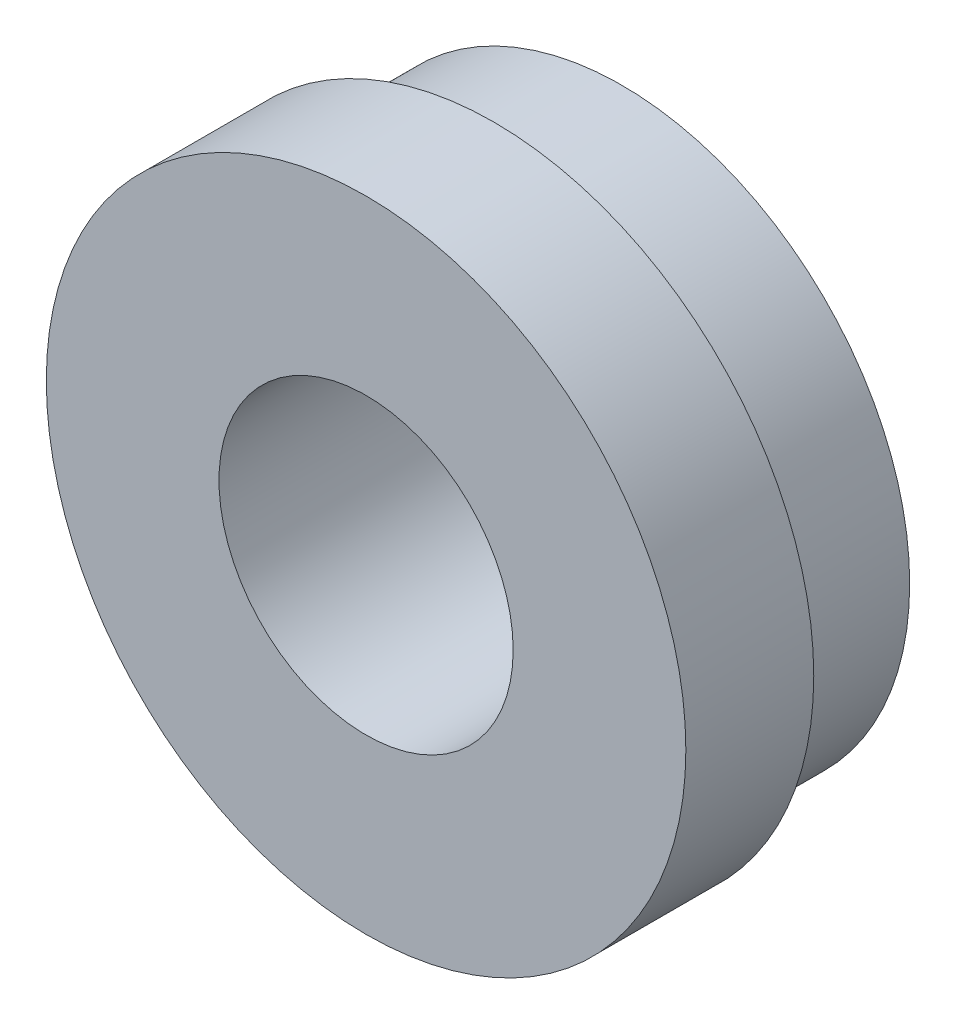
ISO-10303-21;
HEADER;
FILE_DESCRIPTION(('STEP AP214'),'2;1');
FILE_NAME('part.step','',(''),(''),'','','');
FILE_SCHEMA(('AUTOMOTIVE_DESIGN { 1 0 10303 214 1 1 1 1 }'));
ENDSEC;
DATA;
#1=APPLICATION_CONTEXT('core data for automotive mechanical design processes');
#2=APPLICATION_PROTOCOL_DEFINITION('international standard','automotive_design',2000,#1);
#3=PRODUCT_CONTEXT('',#1,'mechanical');
#4=PRODUCT('Part','Part','',(#3));
#5=PRODUCT_RELATED_PRODUCT_CATEGORY('part','',(#4));
#6=PRODUCT_DEFINITION_FORMATION('','',#4);
#7=PRODUCT_DEFINITION_CONTEXT('part definition',#1,'design');
#8=PRODUCT_DEFINITION('design','',#6,#7);
#9=PRODUCT_DEFINITION_SHAPE('','',#8);
#10=(LENGTH_UNIT() NAMED_UNIT(*) SI_UNIT(.MILLI.,.METRE.));
#11=(NAMED_UNIT(*) PLANE_ANGLE_UNIT() SI_UNIT($,.RADIAN.));
#12=(NAMED_UNIT(*) SI_UNIT($,.STERADIAN.) SOLID_ANGLE_UNIT());
#13=UNCERTAINTY_MEASURE_WITH_UNIT(LENGTH_MEASURE(1.E-05),#10,'distance_accuracy_value','');
#14=(GEOMETRIC_REPRESENTATION_CONTEXT(3) GLOBAL_UNCERTAINTY_ASSIGNED_CONTEXT((#13)) GLOBAL_UNIT_ASSIGNED_CONTEXT((#10,
#11,#12)) REPRESENTATION_CONTEXT('',''));
#15=CARTESIAN_POINT('',(0.,0.,0.));
#16=DIRECTION('',(0.,0.,1.));
#17=DIRECTION('',(1.,0.,0.));
#18=AXIS2_PLACEMENT_3D('',#15,#16,#17);
#19=CARTESIAN_POINT('',(0.,0.,-19.9999999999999));
#20=DIRECTION('',(0.,0.,1.));
#21=DIRECTION('',(1.,0.,0.));
#22=AXIS2_PLACEMENT_3D('',#19,#20,#21);
#23=CYLINDRICAL_SURFACE('',#22,45.);
#24=CARTESIAN_POINT('',(0.,0.,-19.9999999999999));
#25=DIRECTION('',(0.,0.,1.));
#26=DIRECTION('',(1.,0.,0.));
#27=AXIS2_PLACEMENT_3D('',#24,#25,#26);
#28=CIRCLE('',#27,45.);
#29=CARTESIAN_POINT('',(45.,0.,-19.9999999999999));
#30=VERTEX_POINT('',#29);
#31=EDGE_CURVE('E10',#30,#30,#28,.T.);
#32=ORIENTED_EDGE('',*,*,#31,.T.);
#33=EDGE_LOOP('',(#32));
#34=FACE_BOUND('',#33,.T.);
#35=CARTESIAN_POINT('',(0.,0.,0.));
#36=DIRECTION('',(0.,0.,1.));
#37=DIRECTION('',(1.,0.,0.));
#38=AXIS2_PLACEMENT_3D('',#35,#36,#37);
#39=CIRCLE('',#38,45.);
#40=CARTESIAN_POINT('',(45.,0.,0.));
#41=VERTEX_POINT('',#40);
#42=EDGE_CURVE('E36',#41,#41,#39,.T.);
#43=ORIENTED_EDGE('',*,*,#42,.F.);
#44=EDGE_LOOP('',(#43));
#45=FACE_BOUND('',#44,.T.);
#46=ADVANCED_FACE('F30',(#34,#45),#23,.T.);
#47=CARTESIAN_POINT('',(0.,0.,-19.9999999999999));
#48=DIRECTION('',(0.,0.,1.));
#49=DIRECTION('',(1.,0.,0.));
#50=AXIS2_PLACEMENT_3D('',#47,#48,#49);
#51=PLANE('',#50);
#52=CARTESIAN_POINT('',(0.,0.,-19.9999999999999));
#53=DIRECTION('',(0.,0.,1.));
#54=DIRECTION('',(1.,0.,0.));
#55=AXIS2_PLACEMENT_3D('',#52,#53,#54);
#56=CIRCLE('',#55,23.);
#57=CARTESIAN_POINT('',(23.,0.,-19.9999999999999));
#58=VERTEX_POINT('',#57);
#59=EDGE_CURVE('E49',#58,#58,#56,.T.);
#60=ORIENTED_EDGE('',*,*,#59,.T.);
#61=EDGE_LOOP('',(#60));
#62=FACE_BOUND('',#61,.T.);
#63=ORIENTED_EDGE('',*,*,#31,.F.);
#64=EDGE_LOOP('',(#63));
#65=FACE_BOUND('',#64,.T.);
#66=ADVANCED_FACE('F68',(#62,#65),#51,.F.);
#67=CARTESIAN_POINT('',(0.,0.,19.9999999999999));
#68=DIRECTION('',(0.,0.,-1.));
#69=DIRECTION('',(-1.,0.,0.));
#70=AXIS2_PLACEMENT_3D('',#67,#68,#69);
#71=CYLINDRICAL_SURFACE('',#70,50.);
#72=CARTESIAN_POINT('',(0.,0.,19.9999999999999));
#73=DIRECTION('',(0.,0.,1.));
#74=DIRECTION('',(1.,0.,0.));
#75=AXIS2_PLACEMENT_3D('',#72,#73,#74);
#76=CIRCLE('',#75,50.);
#77=CARTESIAN_POINT('',(50.,0.,19.9999999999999));
#78=VERTEX_POINT('',#77);
#79=EDGE_CURVE('E40',#78,#78,#76,.T.);
#80=ORIENTED_EDGE('',*,*,#79,.F.);
#81=EDGE_LOOP('',(#80));
#82=FACE_BOUND('',#81,.T.);
#83=CARTESIAN_POINT('',(0.,0.,0.));
#84=DIRECTION('',(0.,0.,1.));
#85=DIRECTION('',(1.,0.,0.));
#86=AXIS2_PLACEMENT_3D('',#83,#84,#85);
#87=CIRCLE('',#86,50.);
#88=CARTESIAN_POINT('',(50.,0.,0.));
#89=VERTEX_POINT('',#88);
#90=EDGE_CURVE('E44',#89,#89,#87,.T.);
#91=ORIENTED_EDGE('',*,*,#90,.T.);
#92=EDGE_LOOP('',(#91));
#93=FACE_BOUND('',#92,.T.);
#94=ADVANCED_FACE('F62',(#82,#93),#71,.T.);
#95=CARTESIAN_POINT('',(0.,0.,19.9999999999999));
#96=DIRECTION('',(0.,0.,1.));
#97=DIRECTION('',(1.,0.,0.));
#98=AXIS2_PLACEMENT_3D('',#95,#96,#97);
#99=PLANE('',#98);
#100=CARTESIAN_POINT('',(0.,0.,19.9999999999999));
#101=DIRECTION('',(0.,0.,1.));
#102=DIRECTION('',(1.,0.,0.));
#103=AXIS2_PLACEMENT_3D('',#100,#101,#102);
#104=CIRCLE('',#103,23.);
#105=CARTESIAN_POINT('',(23.,0.,19.9999999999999));
#106=VERTEX_POINT('',#105);
#107=EDGE_CURVE('E52',#106,#106,#104,.T.);
#108=ORIENTED_EDGE('',*,*,#107,.F.);
#109=EDGE_LOOP('',(#108));
#110=FACE_BOUND('',#109,.T.);
#111=ORIENTED_EDGE('',*,*,#79,.T.);
#112=EDGE_LOOP('',(#111));
#113=FACE_BOUND('',#112,.T.);
#114=ADVANCED_FACE('F58',(#110,#113),#99,.T.);
#115=CARTESIAN_POINT('',(0.,0.,0.));
#116=DIRECTION('',(0.,0.,1.));
#117=DIRECTION('',(1.,0.,0.));
#118=AXIS2_PLACEMENT_3D('',#115,#116,#117);
#119=PLANE('',#118);
#120=ORIENTED_EDGE('',*,*,#42,.T.);
#121=EDGE_LOOP('',(#120));
#122=FACE_BOUND('',#121,.T.);
#123=ORIENTED_EDGE('',*,*,#90,.F.);
#124=EDGE_LOOP('',(#123));
#125=FACE_BOUND('',#124,.T.);
#126=ADVANCED_FACE('F61',(#122,#125),#119,.F.);
#127=CARTESIAN_POINT('',(0.,0.,-19.9999999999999));
#128=DIRECTION('',(0.,0.,1.));
#129=DIRECTION('',(1.,0.,0.));
#130=AXIS2_PLACEMENT_3D('',#127,#128,#129);
#131=CYLINDRICAL_SURFACE('',#130,23.);
#132=ORIENTED_EDGE('',*,*,#59,.F.);
#133=EDGE_LOOP('',(#132));
#134=FACE_BOUND('',#133,.T.);
#135=ORIENTED_EDGE('',*,*,#107,.T.);
#136=EDGE_LOOP('',(#135));
#137=FACE_BOUND('',#136,.T.);
#138=ADVANCED_FACE('F56',(#134,#137),#131,.F.);
#139=CLOSED_SHELL('',(#46,#66,#94,#114,#126,#138));
#140=MANIFOLD_SOLID_BREP('B2',#139);
#141=ADVANCED_BREP_SHAPE_REPRESENTATION('',(#18,#140),#14);
#142=SHAPE_DEFINITION_REPRESENTATION(#9,#141);
ENDSEC;
END-ISO-10303-21;
